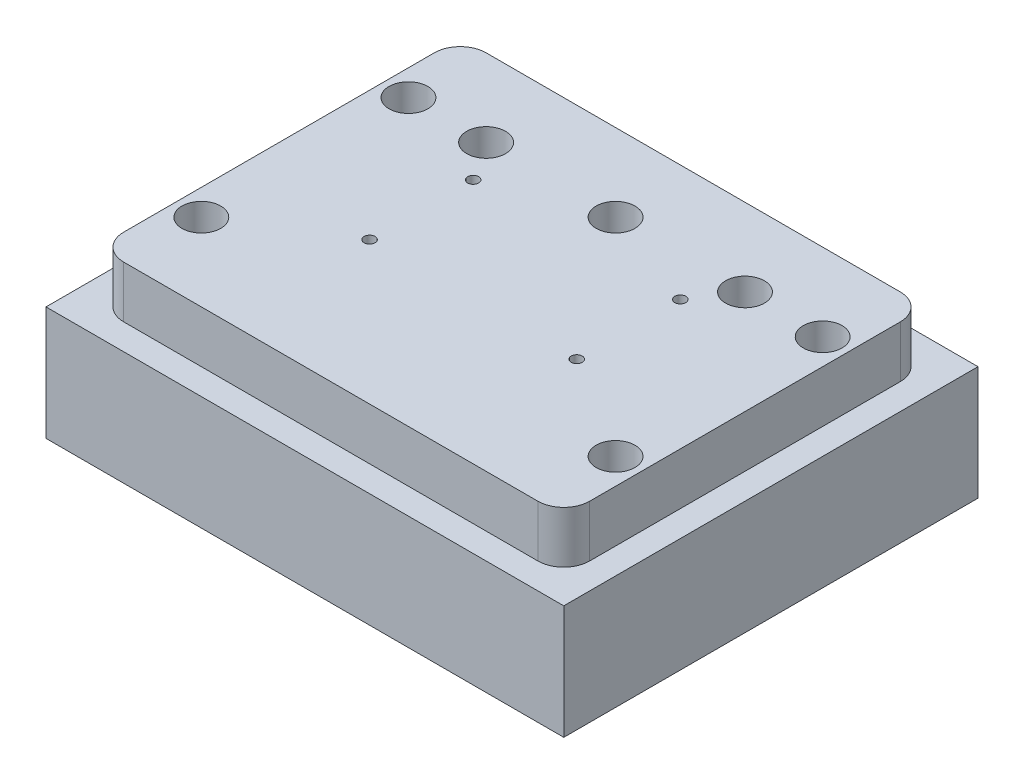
from build123d import *

# Parameters (mm, degrees)
SKETCH1_W                        = 127
SKETCH1_H                        = 101.6
BOSS_EXTRUDE1_DEPTH              = 27.94
SKETCH2_W                        = 114.3
SKETCH2_H                        = 88.9
BOSS_EXTRUDE2_DEPTH              = 12.7
F_3_8_0_375_DIAMETER_HOLE1_D     = 9.525
F_3_8_0_375_DIAMETER_HOLE2_D     = 9.525
F_3_8_0_375_DIAMETER_HOLE2_DEPTH = 33.02
F_3_8_0_375_DIAMETER_HOLE2_TIP   = 2.861599
F_3_8_24_TAPPED_HOLE1_D          = 8.4328
F_3_8_24_TAPPED_HOLE1_DEPTH      = 25.4
F_3_8_24_TAPPED_HOLE1_TIP        = 2.533469
F_3_8_0_375_DIAMETER_HOLE3_D     = 9.525
F_3_8_0_375_DIAMETER_HOLE3_DEPTH = 25.4
F_3_8_0_375_DIAMETER_HOLE3_TIP   = 2.861599
F_6_32_TAPPED_HOLE1_D            = 2.7051
F_6_32_TAPPED_HOLE1_DEPTH        = 7.62
F_6_32_TAPPED_HOLE1_TIP          = 0.812694
SKETCH15_W                       = 29.21
SKETCH15_H                       = 11.43
SKETCH15_W_2                     = 20.828
CUT_EXTRUDE1_DEPTH               = 12.7
F_4_40_TAPPED_HOLE1_D            = 2.2606
F_4_40_TAPPED_HOLE1_DEPTH        = 9.525
F_4_40_TAPPED_HOLE1_TIP          = 0.679153
CUT_EXTRUDE2_DEPTH               = 12.7


with BuildPart() as part:
    # Sketch1 → Boss-Extrude1 (new body)
    with BuildSketch(Plane(origin=(0, 0, 0), x_dir=(1, 0, 0), z_dir=(0, 1, 0))):
        with Locations((16.703575, -30.001589)):
            Rectangle(SKETCH1_W, SKETCH1_H)
    extrude(amount=BOSS_EXTRUDE1_DEPTH)

    # Sketch2 → Boss-Extrude2 (add)
    with BuildSketch(Plane(origin=(0, 27.94, 0), x_dir=(1, 0, 0), z_dir=(0, 1, 0))):
        with Locations((16.703575, -30.001589)):
            Rectangle(SKETCH2_W, SKETCH2_H)
    extrude(amount=BOSS_EXTRUDE2_DEPTH)

    # 3_8 _0.375_ Diameter Hole1 (through all)
    with Locations(Plane(origin=(0, 40.64, 0), x_dir=(1, 0, 0), z_dir=(0, 1, 0))):
        with Locations((-34.096425, -4.601589), (67.503575, -4.601589), (-34.096425, -55.401589), (67.503575, -55.401589)):
            Hole(F_3_8_0_375_DIAMETER_HOLE1_D / 2)

    # 3_8 _0.375_ Diameter Hole2
    with Locations(Plane(origin=(0, 40.64, 0), x_dir=(1, 0, 0), z_dir=(0, 1, 0))):
        with Locations((-15.046425, -4.601589), (16.703575, -4.601589), (48.453575, -4.601589)):
            Hole(F_3_8_0_375_DIAMETER_HOLE2_D / 2, depth=F_3_8_0_375_DIAMETER_HOLE2_DEPTH)
            with Locations((0, 0, -(F_3_8_0_375_DIAMETER_HOLE2_DEPTH + F_3_8_0_375_DIAMETER_HOLE2_TIP / 2))):  # 118° drill point
                Cone(0, F_3_8_0_375_DIAMETER_HOLE2_D / 2, F_3_8_0_375_DIAMETER_HOLE2_TIP, mode=Mode.SUBTRACT)

    # 3_8-24 Tapped Hole1
    with Locations(Plane(origin=(0, 0, -20.798411), x_dir=(-1, 0, 0), z_dir=(0, 0, -1))):
        with Locations((-16.703575, 12.7)):
            Hole(F_3_8_24_TAPPED_HOLE1_D / 2, depth=F_3_8_24_TAPPED_HOLE1_DEPTH)
            with Locations((0, 0, -(F_3_8_24_TAPPED_HOLE1_DEPTH + F_3_8_24_TAPPED_HOLE1_TIP / 2))):  # 118° drill point
                Cone(0, F_3_8_24_TAPPED_HOLE1_D / 2, F_3_8_24_TAPPED_HOLE1_TIP, mode=Mode.SUBTRACT)

    # 3_8 _0.375_ Diameter Hole3
    with Locations(Plane(origin=(0, 0, -20.798411), x_dir=(-1, 0, 0), z_dir=(0, 0, -1))):
        with Locations((-48.453575, 12.7), (15.046425, 12.7)):
            Hole(F_3_8_0_375_DIAMETER_HOLE3_D / 2, depth=F_3_8_0_375_DIAMETER_HOLE3_DEPTH)
            with Locations((0, 0, -(F_3_8_0_375_DIAMETER_HOLE3_DEPTH + F_3_8_0_375_DIAMETER_HOLE3_TIP / 2))):  # 118° drill point
                Cone(0, F_3_8_0_375_DIAMETER_HOLE3_D / 2, F_3_8_0_375_DIAMETER_HOLE3_TIP, mode=Mode.SUBTRACT)

    # 6-32 Tapped Hole1
    with Locations(Plane(origin=(0, 40.64, 0), x_dir=(1, 0, 0), z_dir=(0, 1, 0))):
        with Locations((-8.696425, -14.126589), (42.103575, -14.126589), (42.103575, -39.526589), (-8.696425, -39.526589)):
            Hole(F_6_32_TAPPED_HOLE1_D / 2, depth=F_6_32_TAPPED_HOLE1_DEPTH)
            with Locations((0, 0, -(F_6_32_TAPPED_HOLE1_DEPTH + F_6_32_TAPPED_HOLE1_TIP / 2))):  # 118° drill point
                Cone(0, F_6_32_TAPPED_HOLE1_D / 2, F_6_32_TAPPED_HOLE1_TIP, mode=Mode.SUBTRACT)

    # Sketch15 → Cut-Extrude1 (cut)
    with BuildSketch(Plane(origin=(0, 0, -20.798411), x_dir=(-1, 0, 0), z_dir=(0, 0, -1))):
        with Locations((-48.453575, 12.7)):
            Rectangle(SKETCH15_W, SKETCH15_H)
        with Locations((15.046425, 12.7)):
            Rectangle(SKETCH15_W_2, SKETCH15_H)
    extrude(amount=-CUT_EXTRUDE1_DEPTH, mode=Mode.SUBTRACT)

    # 4-40 Tapped Hole1
    with Locations(Plane(origin=(0, 0, -20.798411), x_dir=(-1, 0, 0), z_dir=(0, 0, -1))):
        with Locations((-65.115975, 12.7), (-31.791175, 12.7), (2.549625, 12.7), (27.543225, 12.7)):
            Hole(F_4_40_TAPPED_HOLE1_D / 2, depth=F_4_40_TAPPED_HOLE1_DEPTH)
            with Locations((0, 0, -(F_4_40_TAPPED_HOLE1_DEPTH + F_4_40_TAPPED_HOLE1_TIP / 2))):  # 118° drill point
                Cone(0, F_4_40_TAPPED_HOLE1_D / 2, F_4_40_TAPPED_HOLE1_TIP, mode=Mode.SUBTRACT)

    # Sketch18 → Cut-Extrude2 (cut)
    with BuildSketch(Plane(origin=(0, 40.64, 0), x_dir=(1, 0, 0), z_dir=(0, 1, 0))):
        with BuildLine():
            Line((-40.446425, 14.448411), (-40.446425, 8.098411))
            ThreePointArc((-40.446425, 8.098411), (-38.586553, 12.588539), (-34.096425, 14.448411))
            Line((-34.096425, 14.448411), (-40.446425, 14.448411))
        make_face()
        with BuildLine():
            Line((73.853575, 14.448411), (67.503575, 14.448411))
            ThreePointArc((67.503575, 14.448411), (71.993703, 12.588539), (73.853575, 8.098411))
            Line((73.853575, 8.098411), (73.853575, 14.448411))
        make_face()
        with BuildLine():
            ThreePointArc((73.853575, -68.101589), (71.993703, -72.591717), (67.503575, -74.451589))
            Line((67.503575, -74.451589), (73.853575, -74.451589))
            Line((73.853575, -74.451589), (73.853575, -68.101589))
        make_face()
        with BuildLine():
            ThreePointArc((-34.096425, -74.451589), (-38.586553, -72.591717), (-40.446425, -68.101589))
            Line((-40.446425, -68.101589), (-40.446425, -74.451589))
            Line((-40.446425, -74.451589), (-34.096425, -74.451589))
        make_face()
    extrude(amount=-CUT_EXTRUDE2_DEPTH, mode=Mode.SUBTRACT)


solid = part.part
